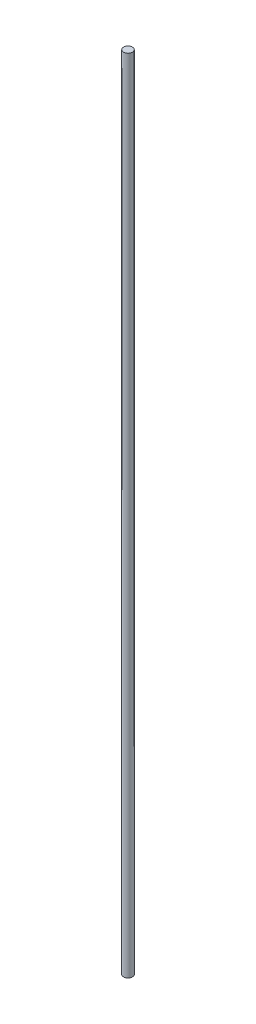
from build123d import *

# Parameters (mm, degrees)
SKIZZE1_R                       = 4
AUFSATZ_LINEAR_AUSTRAGEN1_DEPTH = 720


with BuildPart() as part:
    # Skizze1 → Aufsatz-Linear austragen1 (new body)
    with BuildSketch(Plane(origin=(0, 0, 0), x_dir=(1, 0, 0), z_dir=(0, 1, 0))):
        with Locations(Location((0, 0, 0), (0, 0, 90))):
            Circle(SKIZZE1_R)
    extrude(amount=AUFSATZ_LINEAR_AUSTRAGEN1_DEPTH)


solid = part.part
